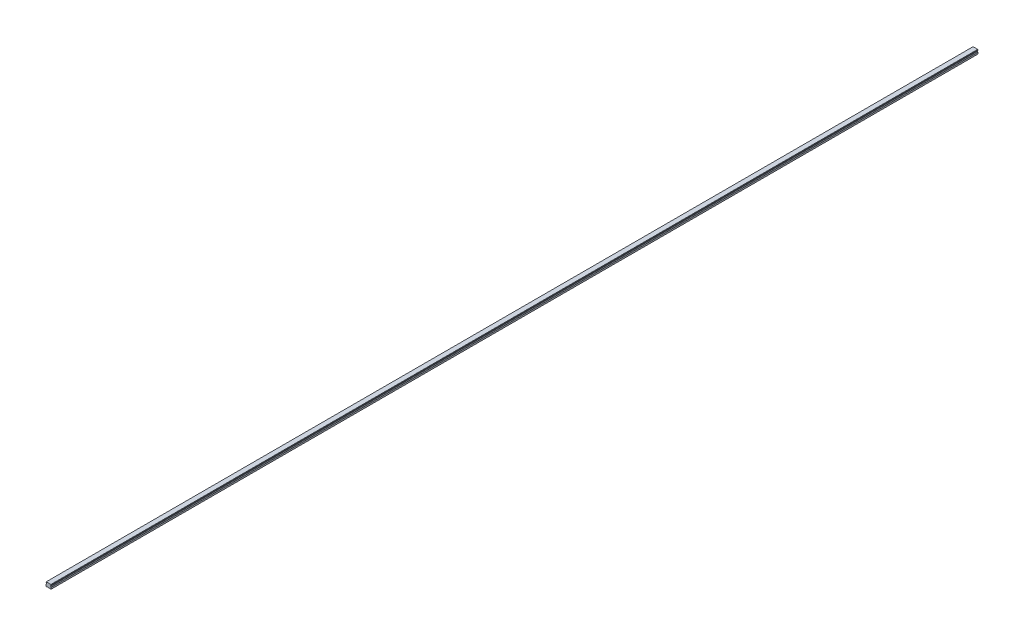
from build123d import *

# Parameters (mm, degrees)
SKETCH1_W           = 20
SKETCH1_H           = 16.3
BOSS_EXTRUDE1_DEPTH = 1790
CUT_EXTRUDE1_DEPTH  = 3581.051073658
CHAMFER1_SIZE       = 1
FILLET1_R           = 1
CUT_EXTRUDE2_DEPTH  = 3581.051073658
SKETCH5_R           = 3
SKETCH5_R_2         = 2.5
CUT_EXTRUDE5_DEPTH  = 10
SKETCH5_2_R         = 2.5
CUT_EXTRUDE6_DEPTH  = 13
LPATTERN2_COUNT     = 60
LPATTERN2_PITCH     = 60


with BuildPart() as part:
    # Sketch1 → Boss-Extrude1 (new, symmetric)
    with BuildSketch(Plane.XY):
        with Locations((0, 8.15)):
            Rectangle(SKETCH1_W, SKETCH1_H)
    extrude(amount=BOSS_EXTRUDE1_DEPTH, both=True)

    # Sketch2 → Cut-Extrude1 (cut, through all)
    with BuildSketch(Plane.XY.offset(1790)):
        Polygon((-10, 14.3), (-10, 7.3), (-7.666666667, 9.633333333), (-7.666666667, 11.966666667), align=None)
        Polygon((7.666666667, 11.966666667), (10, 14.3), (10, 7.3), (7.666666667, 9.633333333), align=None)
    extrude(amount=-CUT_EXTRUDE1_DEPTH, mode=Mode.SUBTRACT)

    # Chamfer1
    chamfer1_edges = [part.edges().sort_by_distance(p)[0] for p in [
        (-10, 16.3, 0),
        (10, 16.3, 0),
        (10, 0, 0),
        (-10, 0, 0),
    ]]
    chamfer(chamfer1_edges, length=CHAMFER1_SIZE)

    # Fillet1
    fillet1_edges = [part.edges().sort_by_distance(p)[0] for p in [
        (-7.666666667, 11.966666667, 0),
        (-7.666666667, 9.633333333, 0),
        (7.666666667, 9.633333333, 0),
        (7.666666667, 11.966666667, 0),
    ]]
    fillet(fillet1_edges, radius=FILLET1_R)

    # Sketch3 → Cut-Extrude2 (cut, through all)
    with BuildSketch(Plane.XY.offset(1790)):
        Polygon((-6, 0), (-5, 1), (5, 1), (6, 0), align=None)
    extrude(amount=-CUT_EXTRUDE2_DEPTH, mode=Mode.SUBTRACT)

    # Sketch5 → Cut-Extrude5 (cut)
    with BuildSketch(Plane.XZ.offset(-1)):
        with Locations(Location((0, 1770, 0), (0, 0, 270))):
            Circle(SKETCH5_R)
        with Locations(Location((0, 1770, 0), (0, 0, 270))):
            Circle(SKETCH5_R_2, mode=Mode.SUBTRACT)
    cut_extrude5 = extrude(amount=-CUT_EXTRUDE5_DEPTH, mode=Mode.SUBTRACT)

    # Sketch5_2 → Cut-Extrude6 (cut)
    with BuildSketch(Plane.XZ.offset(-1)):
        with Locations(Location((0, 1770, 0), (0, 0, 270))):
            Circle(SKETCH5_2_R)
    cut_extrude6 = extrude(amount=-CUT_EXTRUDE6_DEPTH, mode=Mode.SUBTRACT)

    # Cut-Extrude7 cone 1 section (on through the dimple's axis) → Cut-Extrude7 (revolve, cut)
    with BuildSketch(Plane(origin=(0, 14, 1770), x_dir=(0, 0, -1), z_dir=(1, 0, 0))):
        Polygon((0, 0), (2.5, 0), (0, 1.443375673), align=None)
    cut_extrude7 = revolve(axis=Axis((0, 14, 1770), (0, 1, 0)), mode=Mode.SUBTRACT)

    # LPattern2: Cut-Extrude5, Cut-Extrude6, Cut-Extrude7 ×60
    with Locations(*[(0, 0, -i * LPATTERN2_PITCH) for i in range(1, LPATTERN2_COUNT)]):
        add(cut_extrude5, mode=Mode.SUBTRACT)
        add(cut_extrude6, mode=Mode.SUBTRACT)
        add(cut_extrude7, mode=Mode.SUBTRACT)


solid = part.part
